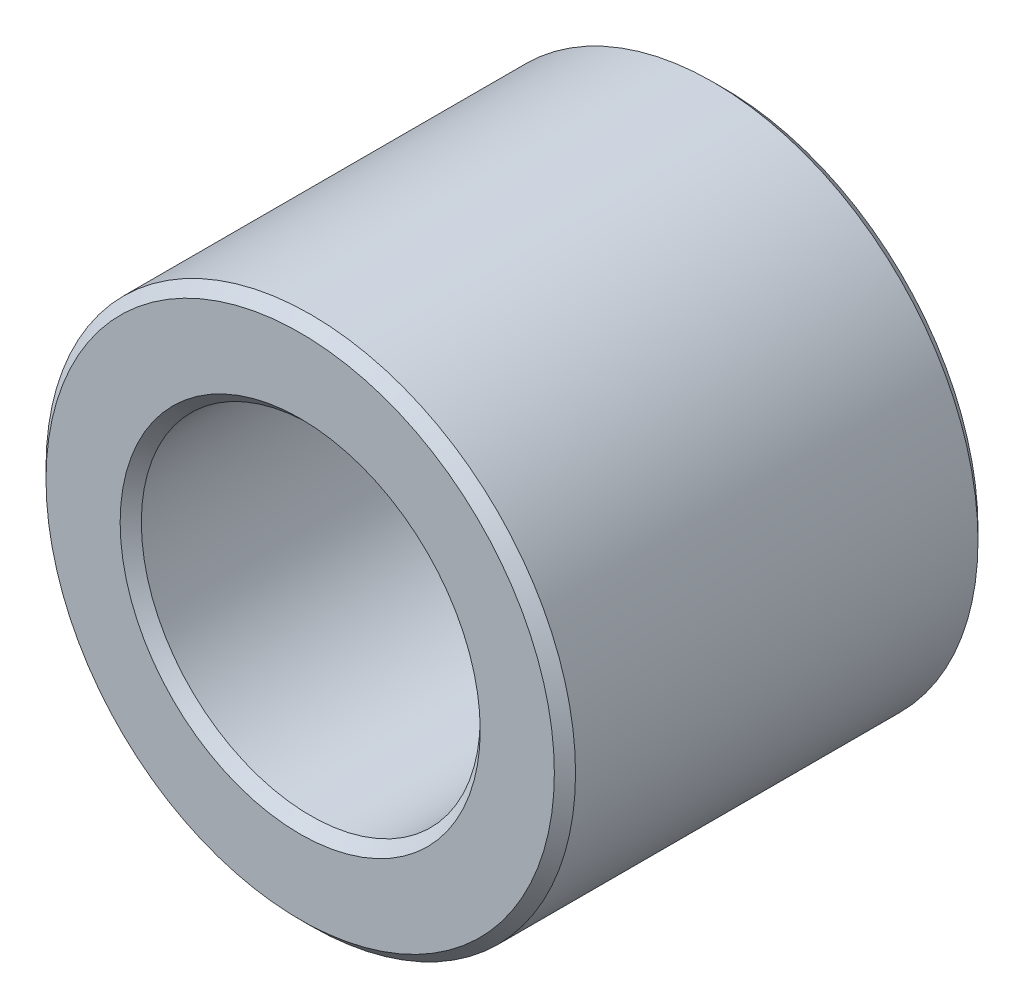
ISO-10303-21;
HEADER;
FILE_DESCRIPTION(('STEP AP214'),'2;1');
FILE_NAME('part.step','',(''),(''),'','','');
FILE_SCHEMA(('AUTOMOTIVE_DESIGN { 1 0 10303 214 1 1 1 1 }'));
ENDSEC;
DATA;
#1=APPLICATION_CONTEXT('core data for automotive mechanical design processes');
#2=APPLICATION_PROTOCOL_DEFINITION('international standard','automotive_design',2000,#1);
#3=PRODUCT_CONTEXT('',#1,'mechanical');
#4=PRODUCT('Part','Part','',(#3));
#5=PRODUCT_RELATED_PRODUCT_CATEGORY('part','',(#4));
#6=PRODUCT_DEFINITION_FORMATION('','',#4);
#7=PRODUCT_DEFINITION_CONTEXT('part definition',#1,'design');
#8=PRODUCT_DEFINITION('design','',#6,#7);
#9=PRODUCT_DEFINITION_SHAPE('','',#8);
#10=(LENGTH_UNIT() NAMED_UNIT(*) SI_UNIT(.MILLI.,.METRE.));
#11=(NAMED_UNIT(*) PLANE_ANGLE_UNIT() SI_UNIT($,.RADIAN.));
#12=(NAMED_UNIT(*) SI_UNIT($,.STERADIAN.) SOLID_ANGLE_UNIT());
#13=UNCERTAINTY_MEASURE_WITH_UNIT(LENGTH_MEASURE(1.E-05),#10,'distance_accuracy_value','');
#14=(GEOMETRIC_REPRESENTATION_CONTEXT(3) GLOBAL_UNCERTAINTY_ASSIGNED_CONTEXT((#13)) GLOBAL_UNIT_ASSIGNED_CONTEXT((#10,
#11,#12)) REPRESENTATION_CONTEXT('',''));
#15=CARTESIAN_POINT('',(0.,0.,0.));
#16=DIRECTION('',(0.,0.,1.));
#17=DIRECTION('',(1.,0.,0.));
#18=AXIS2_PLACEMENT_3D('',#15,#16,#17);
#19=CARTESIAN_POINT('',(0.,0.,4.));
#20=DIRECTION('',(0.,0.,1.));
#21=DIRECTION('',(1.,0.,0.));
#22=AXIS2_PLACEMENT_3D('',#19,#20,#21);
#23=PLANE('',#22);
#24=CARTESIAN_POINT('',(0.,0.,4.));
#25=DIRECTION('',(0.,0.,1.));
#26=DIRECTION('',(1.,0.,0.));
#27=AXIS2_PLACEMENT_3D('',#24,#25,#26);
#28=CIRCLE('',#27,3.4);
#29=CARTESIAN_POINT('',(3.4,0.,4.));
#30=VERTEX_POINT('',#29);
#31=EDGE_CURVE('E10',#30,#30,#28,.F.);
#32=ORIENTED_EDGE('',*,*,#31,.T.);
#33=EDGE_LOOP('',(#32));
#34=FACE_BOUND('',#33,.T.);
#35=CARTESIAN_POINT('',(0.,0.,4.));
#36=DIRECTION('',(0.,0.,1.));
#37=DIRECTION('',(1.,0.,0.));
#38=AXIS2_PLACEMENT_3D('',#35,#36,#37);
#39=CIRCLE('',#38,4.8);
#40=CARTESIAN_POINT('',(4.8,0.,4.));
#41=VERTEX_POINT('',#40);
#42=EDGE_CURVE('E45',#41,#41,#39,.T.);
#43=ORIENTED_EDGE('',*,*,#42,.T.);
#44=EDGE_LOOP('',(#43));
#45=FACE_BOUND('',#44,.T.);
#46=ADVANCED_FACE('F37',(#34,#45),#23,.T.);
#47=CARTESIAN_POINT('',(0.,0.,-4.));
#48=DIRECTION('',(0.,0.,1.));
#49=DIRECTION('',(1.,0.,0.));
#50=AXIS2_PLACEMENT_3D('',#47,#48,#49);
#51=PLANE('',#50);
#52=CARTESIAN_POINT('',(0.,0.,-4.));
#53=DIRECTION('',(0.,0.,1.));
#54=DIRECTION('',(1.,0.,0.));
#55=AXIS2_PLACEMENT_3D('',#52,#53,#54);
#56=CIRCLE('',#55,4.8);
#57=CARTESIAN_POINT('',(4.8,0.,-4.));
#58=VERTEX_POINT('',#57);
#59=EDGE_CURVE('E62',#58,#58,#56,.F.);
#60=ORIENTED_EDGE('',*,*,#59,.T.);
#61=EDGE_LOOP('',(#60));
#62=FACE_BOUND('',#61,.T.);
#63=CARTESIAN_POINT('',(0.,0.,-4.));
#64=DIRECTION('',(0.,0.,1.));
#65=DIRECTION('',(1.,0.,0.));
#66=AXIS2_PLACEMENT_3D('',#63,#64,#65);
#67=CIRCLE('',#66,3.4);
#68=CARTESIAN_POINT('',(3.4,0.,-4.));
#69=VERTEX_POINT('',#68);
#70=EDGE_CURVE('E66',#69,#69,#67,.T.);
#71=ORIENTED_EDGE('',*,*,#70,.T.);
#72=EDGE_LOOP('',(#71));
#73=FACE_BOUND('',#72,.T.);
#74=ADVANCED_FACE('F89',(#62,#73),#51,.F.);
#75=CARTESIAN_POINT('',(0.,0.,4.));
#76=DIRECTION('',(0.,0.,-1.));
#77=DIRECTION('',(-1.,0.,0.));
#78=AXIS2_PLACEMENT_3D('',#75,#76,#77);
#79=CYLINDRICAL_SURFACE('',#78,5.);
#80=CARTESIAN_POINT('',(0.,0.,-3.8));
#81=DIRECTION('',(0.,0.,1.));
#82=DIRECTION('',(1.,0.,0.));
#83=AXIS2_PLACEMENT_3D('',#80,#81,#82);
#84=CIRCLE('',#83,5.);
#85=CARTESIAN_POINT('',(5.,0.,-3.8));
#86=VERTEX_POINT('',#85);
#87=EDGE_CURVE('E70',#86,#86,#84,.T.);
#88=ORIENTED_EDGE('',*,*,#87,.T.);
#89=EDGE_LOOP('',(#88));
#90=FACE_BOUND('',#89,.T.);
#91=CARTESIAN_POINT('',(0.,0.,3.8));
#92=DIRECTION('',(0.,0.,1.));
#93=DIRECTION('',(1.,0.,0.));
#94=AXIS2_PLACEMENT_3D('',#91,#92,#93);
#95=CIRCLE('',#94,5.);
#96=CARTESIAN_POINT('',(5.,0.,3.8));
#97=VERTEX_POINT('',#96);
#98=EDGE_CURVE('E73',#97,#97,#95,.F.);
#99=ORIENTED_EDGE('',*,*,#98,.T.);
#100=EDGE_LOOP('',(#99));
#101=FACE_BOUND('',#100,.T.);
#102=ADVANCED_FACE('F78',(#90,#101),#79,.T.);
#103=CARTESIAN_POINT('',(0.,0.,4.));
#104=DIRECTION('',(0.,0.,-1.));
#105=DIRECTION('',(-1.,0.,0.));
#106=AXIS2_PLACEMENT_3D('',#103,#104,#105);
#107=CYLINDRICAL_SURFACE('',#106,3.2);
#108=CARTESIAN_POINT('',(0.,0.,-3.8));
#109=DIRECTION('',(0.,0.,1.));
#110=DIRECTION('',(1.,0.,0.));
#111=AXIS2_PLACEMENT_3D('',#108,#109,#110);
#112=CIRCLE('',#111,3.2);
#113=CARTESIAN_POINT('',(3.2,0.,-3.8));
#114=VERTEX_POINT('',#113);
#115=EDGE_CURVE('E51',#114,#114,#112,.F.);
#116=ORIENTED_EDGE('',*,*,#115,.T.);
#117=EDGE_LOOP('',(#116));
#118=FACE_BOUND('',#117,.T.);
#119=CARTESIAN_POINT('',(0.,0.,3.8));
#120=DIRECTION('',(0.,0.,1.));
#121=DIRECTION('',(1.,0.,0.));
#122=AXIS2_PLACEMENT_3D('',#119,#120,#121);
#123=CIRCLE('',#122,3.2);
#124=CARTESIAN_POINT('',(3.2,0.,3.8));
#125=VERTEX_POINT('',#124);
#126=EDGE_CURVE('E56',#125,#125,#123,.T.);
#127=ORIENTED_EDGE('',*,*,#126,.T.);
#128=EDGE_LOOP('',(#127));
#129=FACE_BOUND('',#128,.T.);
#130=ADVANCED_FACE('F97',(#118,#129),#107,.F.);
#131=CARTESIAN_POINT('',(0.,0.,-3.8));
#132=DIRECTION('',(0.,0.,1.));
#133=DIRECTION('',(1.,0.,0.));
#134=AXIS2_PLACEMENT_3D('',#131,#132,#133);
#135=CONICAL_SURFACE('',#134,5.,0.78539816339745);
#136=ORIENTED_EDGE('',*,*,#59,.F.);
#137=EDGE_LOOP('',(#136));
#138=FACE_BOUND('',#137,.T.);
#139=ORIENTED_EDGE('',*,*,#87,.F.);
#140=EDGE_LOOP('',(#139));
#141=FACE_BOUND('',#140,.T.);
#142=ADVANCED_FACE('F102',(#138,#141),#135,.T.);
#143=CARTESIAN_POINT('',(0.,0.,-4.));
#144=DIRECTION('',(0.,0.,-1.));
#145=DIRECTION('',(-1.,0.,0.));
#146=AXIS2_PLACEMENT_3D('',#143,#144,#145);
#147=CONICAL_SURFACE('',#146,3.4,0.785398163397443);
#148=ORIENTED_EDGE('',*,*,#115,.F.);
#149=EDGE_LOOP('',(#148));
#150=FACE_BOUND('',#149,.T.);
#151=ORIENTED_EDGE('',*,*,#70,.F.);
#152=EDGE_LOOP('',(#151));
#153=FACE_BOUND('',#152,.T.);
#154=ADVANCED_FACE('F86',(#150,#153),#147,.F.);
#155=CARTESIAN_POINT('',(0.,0.,3.8));
#156=DIRECTION('',(0.,0.,1.));
#157=DIRECTION('',(1.,0.,0.));
#158=AXIS2_PLACEMENT_3D('',#155,#156,#157);
#159=CONICAL_SURFACE('',#158,3.2,0.785398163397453);
#160=ORIENTED_EDGE('',*,*,#31,.F.);
#161=EDGE_LOOP('',(#160));
#162=FACE_BOUND('',#161,.T.);
#163=ORIENTED_EDGE('',*,*,#126,.F.);
#164=EDGE_LOOP('',(#163));
#165=FACE_BOUND('',#164,.T.);
#166=ADVANCED_FACE('F82',(#162,#165),#159,.F.);
#167=CARTESIAN_POINT('',(0.,0.,4.));
#168=DIRECTION('',(0.,0.,-1.));
#169=DIRECTION('',(-1.,0.,0.));
#170=AXIS2_PLACEMENT_3D('',#167,#168,#169);
#171=CONICAL_SURFACE('',#170,4.8,0.785398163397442);
#172=ORIENTED_EDGE('',*,*,#98,.F.);
#173=EDGE_LOOP('',(#172));
#174=FACE_BOUND('',#173,.T.);
#175=ORIENTED_EDGE('',*,*,#42,.F.);
#176=EDGE_LOOP('',(#175));
#177=FACE_BOUND('',#176,.T.);
#178=ADVANCED_FACE('F39',(#174,#177),#171,.T.);
#179=CLOSED_SHELL('',(#46,#74,#102,#130,#142,#154,#166,#178));
#180=MANIFOLD_SOLID_BREP('B2',#179);
#181=ADVANCED_BREP_SHAPE_REPRESENTATION('',(#18,#180),#14);
#182=SHAPE_DEFINITION_REPRESENTATION(#9,#181);
ENDSEC;
END-ISO-10303-21;
